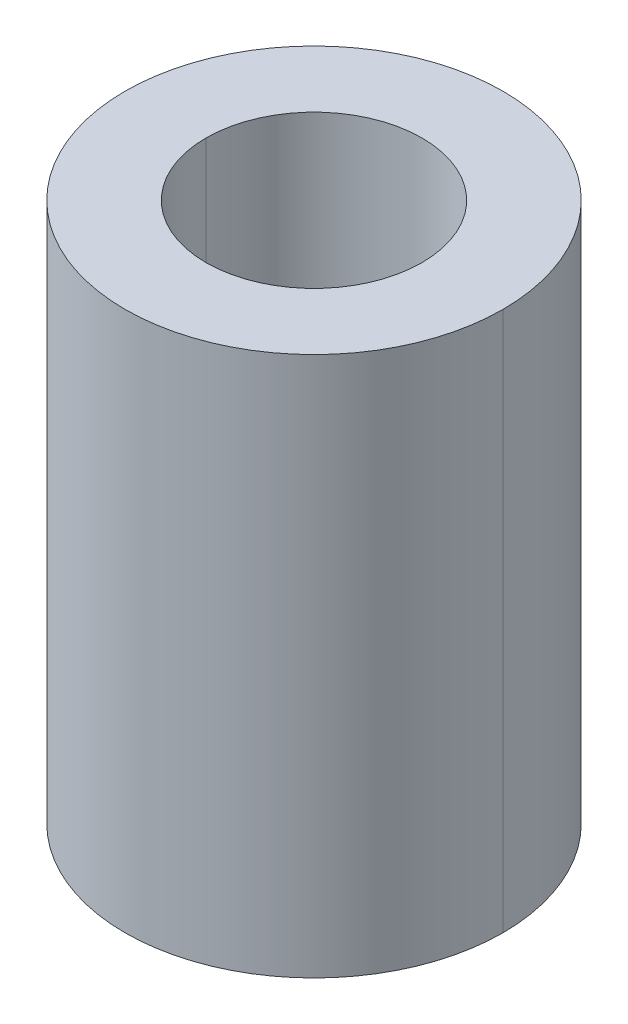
ISO-10303-21;
HEADER;
FILE_DESCRIPTION(('STEP AP214'),'2;1');
FILE_NAME('part.step','',(''),(''),'','','');
FILE_SCHEMA(('AUTOMOTIVE_DESIGN { 1 0 10303 214 1 1 1 1 }'));
ENDSEC;
DATA;
#1=APPLICATION_CONTEXT('core data for automotive mechanical design processes');
#2=APPLICATION_PROTOCOL_DEFINITION('international standard','automotive_design',2000,#1);
#3=PRODUCT_CONTEXT('',#1,'mechanical');
#4=PRODUCT('Part','Part','',(#3));
#5=PRODUCT_RELATED_PRODUCT_CATEGORY('part','',(#4));
#6=PRODUCT_DEFINITION_FORMATION('','',#4);
#7=PRODUCT_DEFINITION_CONTEXT('part definition',#1,'design');
#8=PRODUCT_DEFINITION('design','',#6,#7);
#9=PRODUCT_DEFINITION_SHAPE('','',#8);
#10=(LENGTH_UNIT() NAMED_UNIT(*) SI_UNIT(.MILLI.,.METRE.));
#11=(NAMED_UNIT(*) PLANE_ANGLE_UNIT() SI_UNIT($,.RADIAN.));
#12=(NAMED_UNIT(*) SI_UNIT($,.STERADIAN.) SOLID_ANGLE_UNIT());
#13=UNCERTAINTY_MEASURE_WITH_UNIT(LENGTH_MEASURE(1.E-05),#10,'distance_accuracy_value','');
#14=(GEOMETRIC_REPRESENTATION_CONTEXT(3) GLOBAL_UNCERTAINTY_ASSIGNED_CONTEXT((#13)) GLOBAL_UNIT_ASSIGNED_CONTEXT((#10,
#11,#12)) REPRESENTATION_CONTEXT('',''));
#15=CARTESIAN_POINT('',(0.,0.,0.));
#16=DIRECTION('',(0.,0.,1.));
#17=DIRECTION('',(1.,0.,0.));
#18=AXIS2_PLACEMENT_3D('',#15,#16,#17);
#19=CARTESIAN_POINT('',(0.,0.,0.));
#20=DIRECTION('',(0.,-1.,0.));
#21=DIRECTION('',(0.,0.,-1.));
#22=AXIS2_PLACEMENT_3D('',#19,#20,#21);
#23=CYLINDRICAL_SURFACE('',#22,6.35);
#24=CARTESIAN_POINT('',(0.,15.875,0.));
#25=DIRECTION('',(0.,-1.,0.));
#26=DIRECTION('',(0.,0.,-1.));
#27=AXIS2_PLACEMENT_3D('',#24,#25,#26);
#28=CIRCLE('',#27,6.35);
#29=CARTESIAN_POINT('',(-6.35,15.875,0.));
#30=VERTEX_POINT('',#29);
#31=CARTESIAN_POINT('',(6.35,15.875,0.));
#32=VERTEX_POINT('',#31);
#33=EDGE_CURVE('E67',#30,#32,#28,.T.);
#34=ORIENTED_EDGE('',*,*,#33,.F.);
#35=DIRECTION('',(0.,-1.,0.));
#36=VECTOR('',#35,1.);
#37=CARTESIAN_POINT('',(-6.35,0.,0.));
#38=LINE('',#37,#36);
#39=CARTESIAN_POINT('',(-6.35,-15.875,0.));
#40=VERTEX_POINT('',#39);
#41=EDGE_CURVE('E59',#30,#40,#38,.T.);
#42=ORIENTED_EDGE('',*,*,#41,.T.);
#43=CARTESIAN_POINT('',(0.,-15.875,0.));
#44=DIRECTION('',(0.,-1.,0.));
#45=DIRECTION('',(0.,0.,-1.));
#46=AXIS2_PLACEMENT_3D('',#43,#44,#45);
#47=CIRCLE('',#46,6.35);
#48=CARTESIAN_POINT('',(6.35,-15.875,0.));
#49=VERTEX_POINT('',#48);
#50=EDGE_CURVE('E80',#49,#40,#47,.F.);
#51=ORIENTED_EDGE('',*,*,#50,.F.);
#52=DIRECTION('',(0.,-1.,0.));
#53=VECTOR('',#52,1.);
#54=CARTESIAN_POINT('',(6.35,0.,0.));
#55=LINE('',#54,#53);
#56=EDGE_CURVE('E54',#49,#32,#55,.F.);
#57=ORIENTED_EDGE('',*,*,#56,.T.);
#58=EDGE_LOOP('',(#34,#42,#51,#57));
#59=FACE_BOUND('',#58,.T.);
#60=ADVANCED_FACE('F16',(#59),#23,.F.);
#61=CARTESIAN_POINT('',(0.,0.,0.));
#62=DIRECTION('',(0.,-1.,0.));
#63=DIRECTION('',(0.,0.,-1.));
#64=AXIS2_PLACEMENT_3D('',#61,#62,#63);
#65=CYLINDRICAL_SURFACE('',#64,6.35);
#66=CARTESIAN_POINT('',(0.,-15.875,0.));
#67=DIRECTION('',(0.,-1.,0.));
#68=DIRECTION('',(0.,0.,-1.));
#69=AXIS2_PLACEMENT_3D('',#66,#67,#68);
#70=CIRCLE('',#69,6.35);
#71=EDGE_CURVE('E64',#40,#49,#70,.F.);
#72=ORIENTED_EDGE('',*,*,#71,.F.);
#73=ORIENTED_EDGE('',*,*,#41,.F.);
#74=CARTESIAN_POINT('',(0.,15.875,0.));
#75=DIRECTION('',(0.,-1.,0.));
#76=DIRECTION('',(0.,0.,-1.));
#77=AXIS2_PLACEMENT_3D('',#74,#75,#76);
#78=CIRCLE('',#77,6.35);
#79=EDGE_CURVE('E19',#32,#30,#78,.T.);
#80=ORIENTED_EDGE('',*,*,#79,.F.);
#81=ORIENTED_EDGE('',*,*,#56,.F.);
#82=EDGE_LOOP('',(#72,#73,#80,#81));
#83=FACE_BOUND('',#82,.T.);
#84=ADVANCED_FACE('F60',(#83),#65,.F.);
#85=CARTESIAN_POINT('',(0.,15.875,0.));
#86=DIRECTION('',(0.,1.,0.));
#87=DIRECTION('',(0.,0.,1.));
#88=AXIS2_PLACEMENT_3D('',#85,#86,#87);
#89=PLANE('',#88);
#90=CARTESIAN_POINT('',(0.,15.875,0.));
#91=DIRECTION('',(0.,-1.,0.));
#92=DIRECTION('',(0.,0.,-1.));
#93=AXIS2_PLACEMENT_3D('',#90,#91,#92);
#94=CIRCLE('',#93,11.1125);
#95=CARTESIAN_POINT('',(-11.1125,15.875,0.));
#96=VERTEX_POINT('',#95);
#97=CARTESIAN_POINT('',(11.1125,15.875,0.));
#98=VERTEX_POINT('',#97);
#99=EDGE_CURVE('E69',#96,#98,#94,.T.);
#100=ORIENTED_EDGE('',*,*,#99,.F.);
#101=CARTESIAN_POINT('',(0.,15.875,0.));
#102=DIRECTION('',(0.,-1.,0.));
#103=DIRECTION('',(0.,0.,-1.));
#104=AXIS2_PLACEMENT_3D('',#101,#102,#103);
#105=CIRCLE('',#104,11.1125);
#106=EDGE_CURVE('E74',#98,#96,#105,.T.);
#107=ORIENTED_EDGE('',*,*,#106,.F.);
#108=EDGE_LOOP('',(#100,#107));
#109=FACE_BOUND('',#108,.T.);
#110=ORIENTED_EDGE('',*,*,#79,.T.);
#111=ORIENTED_EDGE('',*,*,#33,.T.);
#112=EDGE_LOOP('',(#110,#111));
#113=FACE_BOUND('',#112,.T.);
#114=ADVANCED_FACE('F70',(#109,#113),#89,.T.);
#115=CARTESIAN_POINT('',(0.,0.,0.));
#116=DIRECTION('',(0.,-1.,0.));
#117=DIRECTION('',(0.,0.,-1.));
#118=AXIS2_PLACEMENT_3D('',#115,#116,#117);
#119=CYLINDRICAL_SURFACE('',#118,11.1125);
#120=DIRECTION('',(0.,-1.,0.));
#121=VECTOR('',#120,1.);
#122=CARTESIAN_POINT('',(-11.1125,0.,0.));
#123=LINE('',#122,#121);
#124=CARTESIAN_POINT('',(-11.1125,-15.875,0.));
#125=VERTEX_POINT('',#124);
#126=EDGE_CURVE('E25',#96,#125,#123,.T.);
#127=ORIENTED_EDGE('',*,*,#126,.F.);
#128=ORIENTED_EDGE('',*,*,#99,.T.);
#129=DIRECTION('',(0.,-1.,0.));
#130=VECTOR('',#129,1.);
#131=CARTESIAN_POINT('',(11.1125,0.,0.));
#132=LINE('',#131,#130);
#133=CARTESIAN_POINT('',(11.1125,-15.875,0.));
#134=VERTEX_POINT('',#133);
#135=EDGE_CURVE('E77',#134,#98,#132,.F.);
#136=ORIENTED_EDGE('',*,*,#135,.F.);
#137=CARTESIAN_POINT('',(0.,-15.875,0.));
#138=DIRECTION('',(0.,-1.,0.));
#139=DIRECTION('',(0.,0.,-1.));
#140=AXIS2_PLACEMENT_3D('',#137,#138,#139);
#141=CIRCLE('',#140,11.1125);
#142=EDGE_CURVE('E34',#125,#134,#141,.T.);
#143=ORIENTED_EDGE('',*,*,#142,.F.);
#144=EDGE_LOOP('',(#127,#128,#136,#143));
#145=FACE_BOUND('',#144,.T.);
#146=ADVANCED_FACE('F83',(#145),#119,.T.);
#147=CARTESIAN_POINT('',(0.,-15.875,0.));
#148=DIRECTION('',(0.,-1.,0.));
#149=DIRECTION('',(0.,0.,-1.));
#150=AXIS2_PLACEMENT_3D('',#147,#148,#149);
#151=PLANE('',#150);
#152=CARTESIAN_POINT('',(0.,-15.875,0.));
#153=DIRECTION('',(0.,-1.,0.));
#154=DIRECTION('',(0.,0.,-1.));
#155=AXIS2_PLACEMENT_3D('',#152,#153,#154);
#156=CIRCLE('',#155,11.1125);
#157=EDGE_CURVE('E11',#125,#134,#156,.F.);
#158=ORIENTED_EDGE('',*,*,#157,.F.);
#159=ORIENTED_EDGE('',*,*,#142,.T.);
#160=EDGE_LOOP('',(#158,#159));
#161=FACE_BOUND('',#160,.T.);
#162=ORIENTED_EDGE('',*,*,#50,.T.);
#163=ORIENTED_EDGE('',*,*,#71,.T.);
#164=EDGE_LOOP('',(#162,#163));
#165=FACE_BOUND('',#164,.T.);
#166=ADVANCED_FACE('F91',(#161,#165),#151,.T.);
#167=CARTESIAN_POINT('',(0.,0.,0.));
#168=DIRECTION('',(0.,-1.,0.));
#169=DIRECTION('',(0.,0.,-1.));
#170=AXIS2_PLACEMENT_3D('',#167,#168,#169);
#171=CYLINDRICAL_SURFACE('',#170,11.1125);
#172=ORIENTED_EDGE('',*,*,#126,.T.);
#173=ORIENTED_EDGE('',*,*,#157,.T.);
#174=ORIENTED_EDGE('',*,*,#135,.T.);
#175=ORIENTED_EDGE('',*,*,#106,.T.);
#176=EDGE_LOOP('',(#172,#173,#174,#175));
#177=FACE_BOUND('',#176,.T.);
#178=ADVANCED_FACE('F88',(#177),#171,.T.);
#179=CLOSED_SHELL('',(#60,#84,#114,#146,#166,#178));
#180=MANIFOLD_SOLID_BREP('B1',#179);
#181=ADVANCED_BREP_SHAPE_REPRESENTATION('',(#18,#180),#14);
#182=SHAPE_DEFINITION_REPRESENTATION(#9,#181);
ENDSEC;
END-ISO-10303-21;
